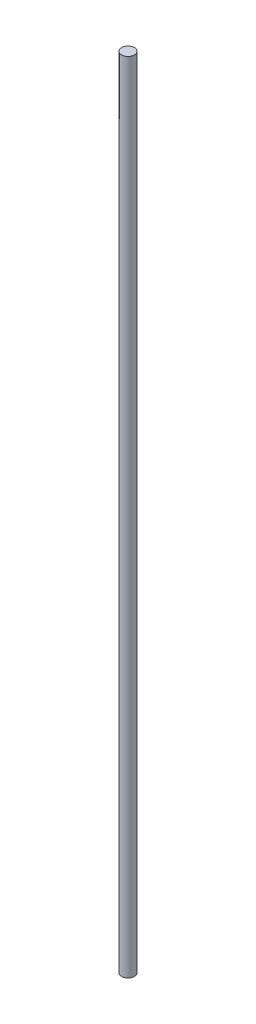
ISO-10303-21;
HEADER;
FILE_DESCRIPTION(('STEP AP214'),'2;1');
FILE_NAME('part.step','',(''),(''),'','','');
FILE_SCHEMA(('AUTOMOTIVE_DESIGN { 1 0 10303 214 1 1 1 1 }'));
ENDSEC;
DATA;
#1=APPLICATION_CONTEXT('core data for automotive mechanical design processes');
#2=APPLICATION_PROTOCOL_DEFINITION('international standard','automotive_design',2000,#1);
#3=PRODUCT_CONTEXT('',#1,'mechanical');
#4=PRODUCT('Part','Part','',(#3));
#5=PRODUCT_RELATED_PRODUCT_CATEGORY('part','',(#4));
#6=PRODUCT_DEFINITION_FORMATION('','',#4);
#7=PRODUCT_DEFINITION_CONTEXT('part definition',#1,'design');
#8=PRODUCT_DEFINITION('design','',#6,#7);
#9=PRODUCT_DEFINITION_SHAPE('','',#8);
#10=(LENGTH_UNIT() NAMED_UNIT(*) SI_UNIT(.MILLI.,.METRE.));
#11=(NAMED_UNIT(*) PLANE_ANGLE_UNIT() SI_UNIT($,.RADIAN.));
#12=(NAMED_UNIT(*) SI_UNIT($,.STERADIAN.) SOLID_ANGLE_UNIT());
#13=UNCERTAINTY_MEASURE_WITH_UNIT(LENGTH_MEASURE(1.E-05),#10,'distance_accuracy_value','');
#14=(GEOMETRIC_REPRESENTATION_CONTEXT(3) GLOBAL_UNCERTAINTY_ASSIGNED_CONTEXT((#13)) GLOBAL_UNIT_ASSIGNED_CONTEXT((#10,
#11,#12)) REPRESENTATION_CONTEXT('',''));
#15=CARTESIAN_POINT('',(0.,0.,0.));
#16=DIRECTION('',(0.,0.,1.));
#17=DIRECTION('',(1.,0.,0.));
#18=AXIS2_PLACEMENT_3D('',#15,#16,#17);
#19=CARTESIAN_POINT('',(0.,187.,0.));
#20=DIRECTION('',(0.,-1.,0.));
#21=DIRECTION('',(0.,0.,-1.));
#22=AXIS2_PLACEMENT_3D('',#19,#20,#21);
#23=CYLINDRICAL_SURFACE('',#22,1.5);
#24=CARTESIAN_POINT('',(0.,187.,0.));
#25=DIRECTION('',(0.,1.,0.));
#26=DIRECTION('',(0.,0.,1.));
#27=AXIS2_PLACEMENT_3D('',#24,#25,#26);
#28=CIRCLE('',#27,1.5);
#29=CARTESIAN_POINT('',(0.,187.,1.5));
#30=VERTEX_POINT('',#29);
#31=EDGE_CURVE('E12',#30,#30,#28,.T.);
#32=ORIENTED_EDGE('',*,*,#31,.F.);
#33=EDGE_LOOP('',(#32));
#34=FACE_BOUND('',#33,.T.);
#35=CARTESIAN_POINT('',(0.,0.,0.));
#36=DIRECTION('',(0.,1.,0.));
#37=DIRECTION('',(0.,0.,1.));
#38=AXIS2_PLACEMENT_3D('',#35,#36,#37);
#39=CIRCLE('',#38,1.5);
#40=CARTESIAN_POINT('',(0.,0.,1.5));
#41=VERTEX_POINT('',#40);
#42=EDGE_CURVE('E46',#41,#41,#39,.T.);
#43=ORIENTED_EDGE('',*,*,#42,.T.);
#44=EDGE_LOOP('',(#43));
#45=FACE_BOUND('',#44,.T.);
#46=ADVANCED_FACE('F43',(#34,#45),#23,.T.);
#47=CARTESIAN_POINT('',(0.,187.,0.));
#48=DIRECTION('',(0.,1.,0.));
#49=DIRECTION('',(0.,0.,1.));
#50=AXIS2_PLACEMENT_3D('',#47,#48,#49);
#51=PLANE('',#50);
#52=ORIENTED_EDGE('',*,*,#31,.T.);
#53=EDGE_LOOP('',(#52));
#54=FACE_BOUND('',#53,.T.);
#55=ADVANCED_FACE('F58',(#54),#51,.T.);
#56=CARTESIAN_POINT('',(0.,0.,0.));
#57=DIRECTION('',(0.,1.,0.));
#58=DIRECTION('',(0.,0.,1.));
#59=AXIS2_PLACEMENT_3D('',#56,#57,#58);
#60=PLANE('',#59);
#61=ORIENTED_EDGE('',*,*,#42,.F.);
#62=EDGE_LOOP('',(#61));
#63=FACE_BOUND('',#62,.T.);
#64=ADVANCED_FACE('F56',(#63),#60,.F.);
#65=CLOSED_SHELL('',(#46,#55,#64));
#66=MANIFOLD_SOLID_BREP('B2',#65);
#67=ADVANCED_BREP_SHAPE_REPRESENTATION('',(#18,#66),#14);
#68=SHAPE_DEFINITION_REPRESENTATION(#9,#67);
ENDSEC;
END-ISO-10303-21;
